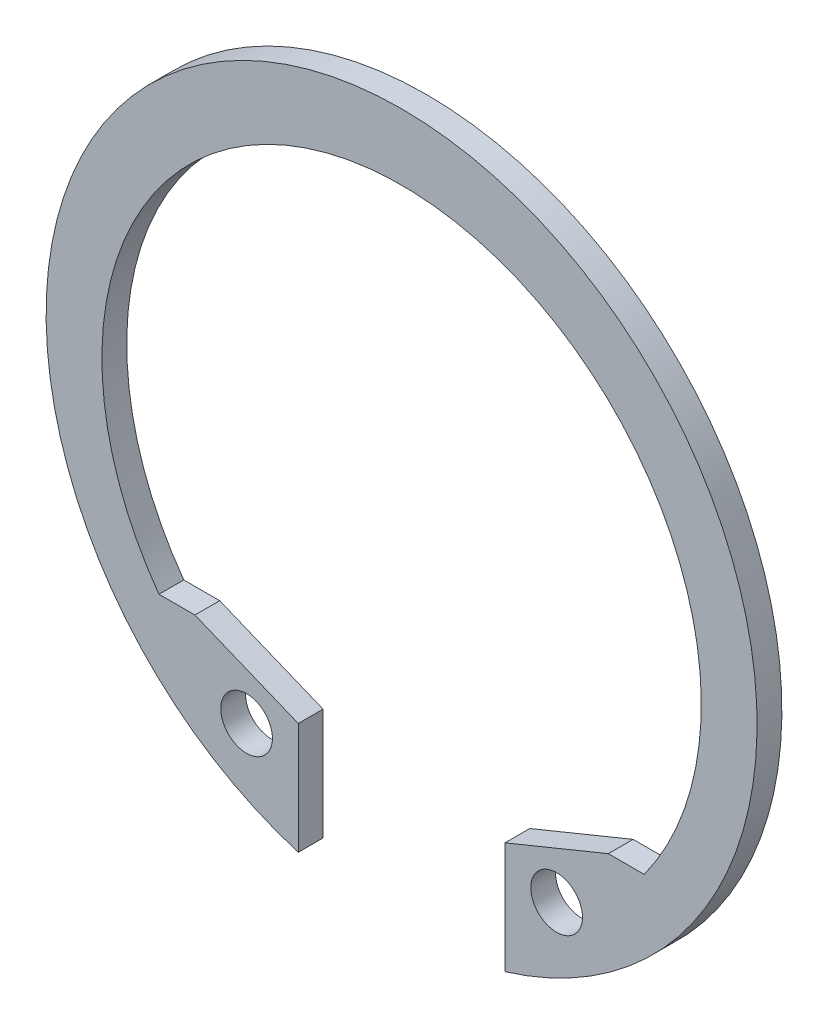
ISO-10303-21;
HEADER;
FILE_DESCRIPTION(('STEP AP214'),'2;1');
FILE_NAME('part.step','',(''),(''),'','','');
FILE_SCHEMA(('AUTOMOTIVE_DESIGN { 1 0 10303 214 1 1 1 1 }'));
ENDSEC;
DATA;
#1=APPLICATION_CONTEXT('core data for automotive mechanical design processes');
#2=APPLICATION_PROTOCOL_DEFINITION('international standard','automotive_design',2000,#1);
#3=PRODUCT_CONTEXT('',#1,'mechanical');
#4=PRODUCT('Part','Part','',(#3));
#5=PRODUCT_RELATED_PRODUCT_CATEGORY('part','',(#4));
#6=PRODUCT_DEFINITION_FORMATION('','',#4);
#7=PRODUCT_DEFINITION_CONTEXT('part definition',#1,'design');
#8=PRODUCT_DEFINITION('design','',#6,#7);
#9=PRODUCT_DEFINITION_SHAPE('','',#8);
#10=(LENGTH_UNIT() NAMED_UNIT(*) SI_UNIT(.MILLI.,.METRE.));
#11=(NAMED_UNIT(*) PLANE_ANGLE_UNIT() SI_UNIT($,.RADIAN.));
#12=(NAMED_UNIT(*) SI_UNIT($,.STERADIAN.) SOLID_ANGLE_UNIT());
#13=UNCERTAINTY_MEASURE_WITH_UNIT(LENGTH_MEASURE(1.E-05),#10,'distance_accuracy_value','');
#14=(GEOMETRIC_REPRESENTATION_CONTEXT(3) GLOBAL_UNCERTAINTY_ASSIGNED_CONTEXT((#13)) GLOBAL_UNIT_ASSIGNED_CONTEXT((#10,
#11,#12)) REPRESENTATION_CONTEXT('',''));
#15=CARTESIAN_POINT('',(0.,0.,0.));
#16=DIRECTION('',(0.,0.,1.));
#17=DIRECTION('',(1.,0.,0.));
#18=AXIS2_PLACEMENT_3D('',#15,#16,#17);
#19=CARTESIAN_POINT('',(0.,0.,-1.19999999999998));
#20=DIRECTION('',(0.,0.,1.));
#21=DIRECTION('',(1.,0.,0.));
#22=AXIS2_PLACEMENT_3D('',#19,#20,#21);
#23=PLANE('',#22);
#24=DIRECTION('',(1.,0.,0.));
#25=VECTOR('',#24,1.);
#26=CARTESIAN_POINT('',(11.73889213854,-9.01166325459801,-1.19999999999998));
#27=LINE('',#26,#25);
#28=CARTESIAN_POINT('',(11.7388921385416,-9.01166325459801,-1.19999999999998));
#29=VERTEX_POINT('',#28);
#30=CARTESIAN_POINT('',(10.,-9.01166325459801,-1.19999999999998));
#31=VERTEX_POINT('',#30);
#32=EDGE_CURVE('E110',#29,#31,#27,.F.);
#33=ORIENTED_EDGE('',*,*,#32,.F.);
#34=CARTESIAN_POINT('',(0.,-0.5,-1.19999999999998));
#35=DIRECTION('',(0.,0.,1.));
#36=DIRECTION('',(1.,0.,0.));
#37=AXIS2_PLACEMENT_3D('',#34,#35,#36);
#38=CIRCLE('',#37,14.5);
#39=CARTESIAN_POINT('',(-11.7388921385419,-9.01166325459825,-1.19999999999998));
#40=VERTEX_POINT('',#39);
#41=EDGE_CURVE('E150',#29,#40,#38,.T.);
#42=ORIENTED_EDGE('',*,*,#41,.T.);
#43=DIRECTION('',(1.,0.,0.));
#44=VECTOR('',#43,1.);
#45=CARTESIAN_POINT('',(-10.,-9.01166325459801,-1.19999999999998));
#46=LINE('',#45,#44);
#47=CARTESIAN_POINT('',(-10.0000000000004,-9.01166325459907,-1.19999999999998));
#48=VERTEX_POINT('',#47);
#49=EDGE_CURVE('E124',#48,#40,#46,.F.);
#50=ORIENTED_EDGE('',*,*,#49,.F.);
#51=DIRECTION('',(-0.925540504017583,0.378648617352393,0.));
#52=VECTOR('',#51,1.);
#53=CARTESIAN_POINT('',(-5.,-11.05721726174,-1.19999999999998));
#54=LINE('',#53,#52);
#55=CARTESIAN_POINT('',(-5.,-11.05721726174,-1.19999999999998));
#56=VERTEX_POINT('',#55);
#57=EDGE_CURVE('E131',#56,#48,#54,.T.);
#58=ORIENTED_EDGE('',*,*,#57,.F.);
#59=DIRECTION('',(0.,1.,0.));
#60=VECTOR('',#59,1.);
#61=CARTESIAN_POINT('',(-5.,-16.45721726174,-1.19999999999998));
#62=LINE('',#61,#60);
#63=CARTESIAN_POINT('',(-5.,-16.4572172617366,-1.19999999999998));
#64=VERTEX_POINT('',#63);
#65=EDGE_CURVE('E89',#64,#56,#62,.T.);
#66=ORIENTED_EDGE('',*,*,#65,.F.);
#67=CARTESIAN_POINT('',(0.,0.,-1.19999999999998));
#68=DIRECTION('',(0.,0.,1.));
#69=DIRECTION('',(1.,0.,0.));
#70=AXIS2_PLACEMENT_3D('',#67,#68,#69);
#71=CIRCLE('',#70,17.2);
#72=CARTESIAN_POINT('',(4.99999999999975,-16.4572172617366,-1.19999999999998));
#73=VERTEX_POINT('',#72);
#74=EDGE_CURVE('E79',#73,#64,#71,.T.);
#75=ORIENTED_EDGE('',*,*,#74,.F.);
#76=DIRECTION('',(0.,1.,0.));
#77=VECTOR('',#76,1.);
#78=CARTESIAN_POINT('',(5.,-11.05721726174,-1.19999999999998));
#79=LINE('',#78,#77);
#80=CARTESIAN_POINT('',(4.99999999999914,-11.0572172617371,-1.19999999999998));
#81=VERTEX_POINT('',#80);
#82=EDGE_CURVE('E86',#81,#73,#79,.F.);
#83=ORIENTED_EDGE('',*,*,#82,.F.);
#84=DIRECTION('',(-0.925540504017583,-0.378648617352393,0.));
#85=VECTOR('',#84,1.);
#86=CARTESIAN_POINT('',(10.,-9.01166325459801,-1.19999999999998));
#87=LINE('',#86,#85);
#88=EDGE_CURVE('E117',#31,#81,#87,.T.);
#89=ORIENTED_EDGE('',*,*,#88,.F.);
#90=EDGE_LOOP('',(#33,#42,#50,#58,#66,#75,#83,#89));
#91=FACE_BOUND('',#90,.T.);
#92=CARTESIAN_POINT('',(-7.50000000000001,-12.30721726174,-1.19999999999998));
#93=DIRECTION('',(0.,0.,1.));
#94=DIRECTION('',(1.,0.,0.));
#95=AXIS2_PLACEMENT_3D('',#92,#93,#94);
#96=CIRCLE('',#95,1.25);
#97=CARTESIAN_POINT('',(-6.25000000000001,-12.30721726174,-1.19999999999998));
#98=VERTEX_POINT('',#97);
#99=EDGE_CURVE('E100',#98,#98,#96,.T.);
#100=ORIENTED_EDGE('',*,*,#99,.T.);
#101=EDGE_LOOP('',(#100));
#102=FACE_BOUND('',#101,.T.);
#103=CARTESIAN_POINT('',(7.50000000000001,-12.30721726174,-1.19999999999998));
#104=DIRECTION('',(0.,0.,1.));
#105=DIRECTION('',(1.,0.,0.));
#106=AXIS2_PLACEMENT_3D('',#103,#104,#105);
#107=CIRCLE('',#106,1.25);
#108=CARTESIAN_POINT('',(8.75,-12.30721726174,-1.19999999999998));
#109=VERTEX_POINT('',#108);
#110=EDGE_CURVE('E19',#109,#109,#107,.T.);
#111=ORIENTED_EDGE('',*,*,#110,.T.);
#112=EDGE_LOOP('',(#111));
#113=FACE_BOUND('',#112,.T.);
#114=ADVANCED_FACE('F16',(#91,#102,#113),#23,.F.);
#115=CARTESIAN_POINT('',(7.50000000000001,-12.30721726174,0.));
#116=DIRECTION('',(0.,0.,1.));
#117=DIRECTION('',(1.,0.,0.));
#118=AXIS2_PLACEMENT_3D('',#115,#116,#117);
#119=CYLINDRICAL_SURFACE('',#118,1.25);
#120=ORIENTED_EDGE('',*,*,#110,.F.);
#121=EDGE_LOOP('',(#120));
#122=FACE_BOUND('',#121,.T.);
#123=CARTESIAN_POINT('',(7.50000000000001,-12.30721726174,0.));
#124=DIRECTION('',(0.,0.,1.));
#125=DIRECTION('',(1.,0.,0.));
#126=AXIS2_PLACEMENT_3D('',#123,#124,#125);
#127=CIRCLE('',#126,1.25);
#128=CARTESIAN_POINT('',(8.75,-12.30721726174,0.));
#129=VERTEX_POINT('',#128);
#130=EDGE_CURVE('E119',#129,#129,#127,.F.);
#131=ORIENTED_EDGE('',*,*,#130,.F.);
#132=EDGE_LOOP('',(#131));
#133=FACE_BOUND('',#132,.T.);
#134=ADVANCED_FACE('F157',(#122,#133),#119,.F.);
#135=CARTESIAN_POINT('',(-7.50000000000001,-12.30721726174,0.));
#136=DIRECTION('',(0.,0.,1.));
#137=DIRECTION('',(1.,0.,0.));
#138=AXIS2_PLACEMENT_3D('',#135,#136,#137);
#139=CYLINDRICAL_SURFACE('',#138,1.25);
#140=ORIENTED_EDGE('',*,*,#99,.F.);
#141=EDGE_LOOP('',(#140));
#142=FACE_BOUND('',#141,.T.);
#143=CARTESIAN_POINT('',(-7.50000000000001,-12.30721726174,0.));
#144=DIRECTION('',(0.,0.,1.));
#145=DIRECTION('',(1.,0.,0.));
#146=AXIS2_PLACEMENT_3D('',#143,#144,#145);
#147=CIRCLE('',#146,1.25);
#148=CARTESIAN_POINT('',(-6.25000000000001,-12.30721726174,0.));
#149=VERTEX_POINT('',#148);
#150=EDGE_CURVE('E145',#149,#149,#147,.F.);
#151=ORIENTED_EDGE('',*,*,#150,.F.);
#152=EDGE_LOOP('',(#151));
#153=FACE_BOUND('',#152,.T.);
#154=ADVANCED_FACE('F160',(#142,#153),#139,.F.);
#155=CARTESIAN_POINT('',(5.,-11.05721726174,0.));
#156=DIRECTION('',(-1.,0.,0.));
#157=DIRECTION('',(0.,0.,1.));
#158=AXIS2_PLACEMENT_3D('',#155,#156,#157);
#159=PLANE('',#158);
#160=DIRECTION('',(0.,0.,1.));
#161=VECTOR('',#160,1.);
#162=CARTESIAN_POINT('',(4.99999999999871,-11.0572172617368,0.));
#163=LINE('',#162,#161);
#164=CARTESIAN_POINT('',(4.99999999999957,-11.057217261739,0.));
#165=VERTEX_POINT('',#164);
#166=EDGE_CURVE('E98',#81,#165,#163,.T.);
#167=ORIENTED_EDGE('',*,*,#166,.F.);
#168=ORIENTED_EDGE('',*,*,#82,.T.);
#169=DIRECTION('',(0.,0.,1.));
#170=VECTOR('',#169,1.);
#171=CARTESIAN_POINT('',(4.9999999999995,-16.4572172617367,0.));
#172=LINE('',#171,#170);
#173=CARTESIAN_POINT('',(4.99999999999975,-16.4572172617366,0.));
#174=VERTEX_POINT('',#173);
#175=EDGE_CURVE('E92',#174,#73,#172,.F.);
#176=ORIENTED_EDGE('',*,*,#175,.F.);
#177=DIRECTION('',(0.,1.,0.));
#178=VECTOR('',#177,1.);
#179=CARTESIAN_POINT('',(5.,0.,0.));
#180=LINE('',#179,#178);
#181=EDGE_CURVE('E144',#165,#174,#180,.F.);
#182=ORIENTED_EDGE('',*,*,#181,.F.);
#183=EDGE_LOOP('',(#167,#168,#176,#182));
#184=FACE_BOUND('',#183,.T.);
#185=ADVANCED_FACE('F95',(#184),#159,.T.);
#186=CARTESIAN_POINT('',(0.,0.,0.));
#187=DIRECTION('',(0.,0.,1.));
#188=DIRECTION('',(1.,0.,0.));
#189=AXIS2_PLACEMENT_3D('',#186,#187,#188);
#190=CYLINDRICAL_SURFACE('',#189,17.2);
#191=DIRECTION('',(0.,0.,-1.));
#192=VECTOR('',#191,1.);
#193=CARTESIAN_POINT('',(-5.,-16.4572172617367,0.));
#194=LINE('',#193,#192);
#195=CARTESIAN_POINT('',(-4.99999999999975,-16.4572172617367,0.));
#196=VERTEX_POINT('',#195);
#197=EDGE_CURVE('E91',#196,#64,#194,.T.);
#198=ORIENTED_EDGE('',*,*,#197,.F.);
#199=CARTESIAN_POINT('',(0.,0.,0.));
#200=DIRECTION('',(0.,0.,1.));
#201=DIRECTION('',(1.,0.,0.));
#202=AXIS2_PLACEMENT_3D('',#199,#200,#201);
#203=CIRCLE('',#202,17.2);
#204=EDGE_CURVE('E103',#174,#196,#203,.T.);
#205=ORIENTED_EDGE('',*,*,#204,.F.);
#206=ORIENTED_EDGE('',*,*,#175,.T.);
#207=ORIENTED_EDGE('',*,*,#74,.T.);
#208=EDGE_LOOP('',(#198,#205,#206,#207));
#209=FACE_BOUND('',#208,.T.);
#210=ADVANCED_FACE('F102',(#209),#190,.T.);
#211=CARTESIAN_POINT('',(-5.,-16.45721726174,0.));
#212=DIRECTION('',(1.,0.,0.));
#213=DIRECTION('',(0.,0.,-1.));
#214=AXIS2_PLACEMENT_3D('',#211,#212,#213);
#215=PLANE('',#214);
#216=ORIENTED_EDGE('',*,*,#197,.T.);
#217=ORIENTED_EDGE('',*,*,#65,.T.);
#218=DIRECTION('',(0.,0.,1.));
#219=VECTOR('',#218,1.);
#220=CARTESIAN_POINT('',(-5.,-11.05721726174,0.));
#221=LINE('',#220,#219);
#222=CARTESIAN_POINT('',(-4.99999999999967,-11.0572172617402,0.));
#223=VERTEX_POINT('',#222);
#224=EDGE_CURVE('E133',#223,#56,#221,.F.);
#225=ORIENTED_EDGE('',*,*,#224,.F.);
#226=DIRECTION('',(0.,1.,0.));
#227=VECTOR('',#226,1.);
#228=CARTESIAN_POINT('',(-4.9999999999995,0.,0.));
#229=LINE('',#228,#227);
#230=EDGE_CURVE('E143',#196,#223,#229,.T.);
#231=ORIENTED_EDGE('',*,*,#230,.F.);
#232=EDGE_LOOP('',(#216,#217,#225,#231));
#233=FACE_BOUND('',#232,.T.);
#234=ADVANCED_FACE('F191',(#233),#215,.T.);
#235=CARTESIAN_POINT('',(-5.,-11.05721726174,0.));
#236=DIRECTION('',(0.378648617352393,0.925540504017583,0.));
#237=DIRECTION('',(-0.925540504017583,0.378648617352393,0.));
#238=AXIS2_PLACEMENT_3D('',#235,#236,#237);
#239=PLANE('',#238);
#240=ORIENTED_EDGE('',*,*,#224,.T.);
#241=ORIENTED_EDGE('',*,*,#57,.T.);
#242=DIRECTION('',(0.,0.,1.));
#243=VECTOR('',#242,1.);
#244=CARTESIAN_POINT('',(-10.,-9.01166325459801,0.));
#245=LINE('',#244,#243);
#246=CARTESIAN_POINT('',(-10.,-9.01166325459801,0.));
#247=VERTEX_POINT('',#246);
#248=EDGE_CURVE('E128',#247,#48,#245,.F.);
#249=ORIENTED_EDGE('',*,*,#248,.F.);
#250=DIRECTION('',(-0.925540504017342,0.378648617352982,0.));
#251=VECTOR('',#250,1.);
#252=CARTESIAN_POINT('',(-5.,-11.05721726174,0.));
#253=LINE('',#252,#251);
#254=EDGE_CURVE('E292',#223,#247,#253,.T.);
#255=ORIENTED_EDGE('',*,*,#254,.F.);
#256=EDGE_LOOP('',(#240,#241,#249,#255));
#257=FACE_BOUND('',#256,.T.);
#258=ADVANCED_FACE('F187',(#257),#239,.T.);
#259=CARTESIAN_POINT('',(-10.,-9.01166325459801,0.));
#260=DIRECTION('',(0.,1.,0.));
#261=DIRECTION('',(0.,0.,1.));
#262=AXIS2_PLACEMENT_3D('',#259,#260,#261);
#263=PLANE('',#262);
#264=ORIENTED_EDGE('',*,*,#248,.T.);
#265=ORIENTED_EDGE('',*,*,#49,.T.);
#266=DIRECTION('',(0.,0.,1.));
#267=VECTOR('',#266,1.);
#268=CARTESIAN_POINT('',(-11.7388921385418,-9.01166325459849,0.));
#269=LINE('',#268,#267);
#270=CARTESIAN_POINT('',(-11.7388921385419,-9.01166325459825,0.));
#271=VERTEX_POINT('',#270);
#272=EDGE_CURVE('E127',#40,#271,#269,.T.);
#273=ORIENTED_EDGE('',*,*,#272,.T.);
#274=DIRECTION('',(1.,0.,0.));
#275=VECTOR('',#274,1.);
#276=CARTESIAN_POINT('',(0.,-9.01166325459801,0.));
#277=LINE('',#276,#275);
#278=EDGE_CURVE('E141',#247,#271,#277,.F.);
#279=ORIENTED_EDGE('',*,*,#278,.F.);
#280=EDGE_LOOP('',(#264,#265,#273,#279));
#281=FACE_BOUND('',#280,.T.);
#282=ADVANCED_FACE('F183',(#281),#263,.T.);
#283=CARTESIAN_POINT('',(0.,-0.5,0.));
#284=DIRECTION('',(0.,0.,1.));
#285=DIRECTION('',(1.,0.,0.));
#286=AXIS2_PLACEMENT_3D('',#283,#284,#285);
#287=CYLINDRICAL_SURFACE('',#286,14.5);
#288=ORIENTED_EDGE('',*,*,#41,.F.);
#289=DIRECTION('',(0.,0.,1.));
#290=VECTOR('',#289,1.);
#291=CARTESIAN_POINT('',(11.7388921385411,-9.01166325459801,0.));
#292=LINE('',#291,#290);
#293=CARTESIAN_POINT('',(11.7388921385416,-9.01166325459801,0.));
#294=VERTEX_POINT('',#293);
#295=EDGE_CURVE('E114',#294,#29,#292,.F.);
#296=ORIENTED_EDGE('',*,*,#295,.F.);
#297=CARTESIAN_POINT('',(0.,-0.5,0.));
#298=DIRECTION('',(0.,0.,1.));
#299=DIRECTION('',(1.,0.,0.));
#300=AXIS2_PLACEMENT_3D('',#297,#298,#299);
#301=CIRCLE('',#300,14.5);
#302=EDGE_CURVE('E139',#271,#294,#301,.F.);
#303=ORIENTED_EDGE('',*,*,#302,.F.);
#304=ORIENTED_EDGE('',*,*,#272,.F.);
#305=EDGE_LOOP('',(#288,#296,#303,#304));
#306=FACE_BOUND('',#305,.T.);
#307=ADVANCED_FACE('F180',(#306),#287,.F.);
#308=CARTESIAN_POINT('',(11.73889213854,-9.01166325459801,0.));
#309=DIRECTION('',(0.,1.,0.));
#310=DIRECTION('',(0.,0.,1.));
#311=AXIS2_PLACEMENT_3D('',#308,#309,#310);
#312=PLANE('',#311);
#313=ORIENTED_EDGE('',*,*,#295,.T.);
#314=ORIENTED_EDGE('',*,*,#32,.T.);
#315=DIRECTION('',(0.,0.,1.));
#316=VECTOR('',#315,1.);
#317=CARTESIAN_POINT('',(10.,-9.01166325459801,0.));
#318=LINE('',#317,#316);
#319=CARTESIAN_POINT('',(10.,-9.01166325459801,0.));
#320=VERTEX_POINT('',#319);
#321=EDGE_CURVE('E34',#320,#31,#318,.F.);
#322=ORIENTED_EDGE('',*,*,#321,.F.);
#323=DIRECTION('',(1.,0.,0.));
#324=VECTOR('',#323,1.);
#325=CARTESIAN_POINT('',(0.,-9.01166325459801,0.));
#326=LINE('',#325,#324);
#327=EDGE_CURVE('E25',#294,#320,#326,.F.);
#328=ORIENTED_EDGE('',*,*,#327,.F.);
#329=EDGE_LOOP('',(#313,#314,#322,#328));
#330=FACE_BOUND('',#329,.T.);
#331=ADVANCED_FACE('F172',(#330),#312,.T.);
#332=CARTESIAN_POINT('',(10.,-9.01166325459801,0.));
#333=DIRECTION('',(-0.378648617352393,0.925540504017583,0.));
#334=DIRECTION('',(-0.925540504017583,-0.378648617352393,0.));
#335=AXIS2_PLACEMENT_3D('',#332,#333,#334);
#336=PLANE('',#335);
#337=ORIENTED_EDGE('',*,*,#321,.T.);
#338=ORIENTED_EDGE('',*,*,#88,.T.);
#339=ORIENTED_EDGE('',*,*,#166,.T.);
#340=DIRECTION('',(-0.925540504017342,-0.378648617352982,0.));
#341=VECTOR('',#340,1.);
#342=CARTESIAN_POINT('',(10.,-9.01166325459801,0.));
#343=LINE('',#342,#341);
#344=EDGE_CURVE('E11',#320,#165,#343,.T.);
#345=ORIENTED_EDGE('',*,*,#344,.F.);
#346=EDGE_LOOP('',(#337,#338,#339,#345));
#347=FACE_BOUND('',#346,.T.);
#348=ADVANCED_FACE('F165',(#347),#336,.T.);
#349=CARTESIAN_POINT('',(0.,0.,0.));
#350=DIRECTION('',(0.,0.,1.));
#351=DIRECTION('',(1.,0.,0.));
#352=AXIS2_PLACEMENT_3D('',#349,#350,#351);
#353=PLANE('',#352);
#354=ORIENTED_EDGE('',*,*,#327,.T.);
#355=ORIENTED_EDGE('',*,*,#344,.T.);
#356=ORIENTED_EDGE('',*,*,#181,.T.);
#357=ORIENTED_EDGE('',*,*,#204,.T.);
#358=ORIENTED_EDGE('',*,*,#230,.T.);
#359=ORIENTED_EDGE('',*,*,#254,.T.);
#360=ORIENTED_EDGE('',*,*,#278,.T.);
#361=ORIENTED_EDGE('',*,*,#302,.T.);
#362=EDGE_LOOP('',(#354,#355,#356,#357,#358,#359,#360,#361));
#363=FACE_BOUND('',#362,.T.);
#364=ORIENTED_EDGE('',*,*,#150,.T.);
#365=EDGE_LOOP('',(#364));
#366=FACE_BOUND('',#365,.T.);
#367=ORIENTED_EDGE('',*,*,#130,.T.);
#368=EDGE_LOOP('',(#367));
#369=FACE_BOUND('',#368,.T.);
#370=ADVANCED_FACE('F163',(#363,#366,#369),#353,.T.);
#371=CLOSED_SHELL('',(#114,#134,#154,#185,#210,#234,#258,#282,#307,#331,#348,#370));
#372=MANIFOLD_SOLID_BREP('B1',#371);
#373=ADVANCED_BREP_SHAPE_REPRESENTATION('',(#18,#372),#14);
#374=SHAPE_DEFINITION_REPRESENTATION(#9,#373);
ENDSEC;
END-ISO-10303-21;
